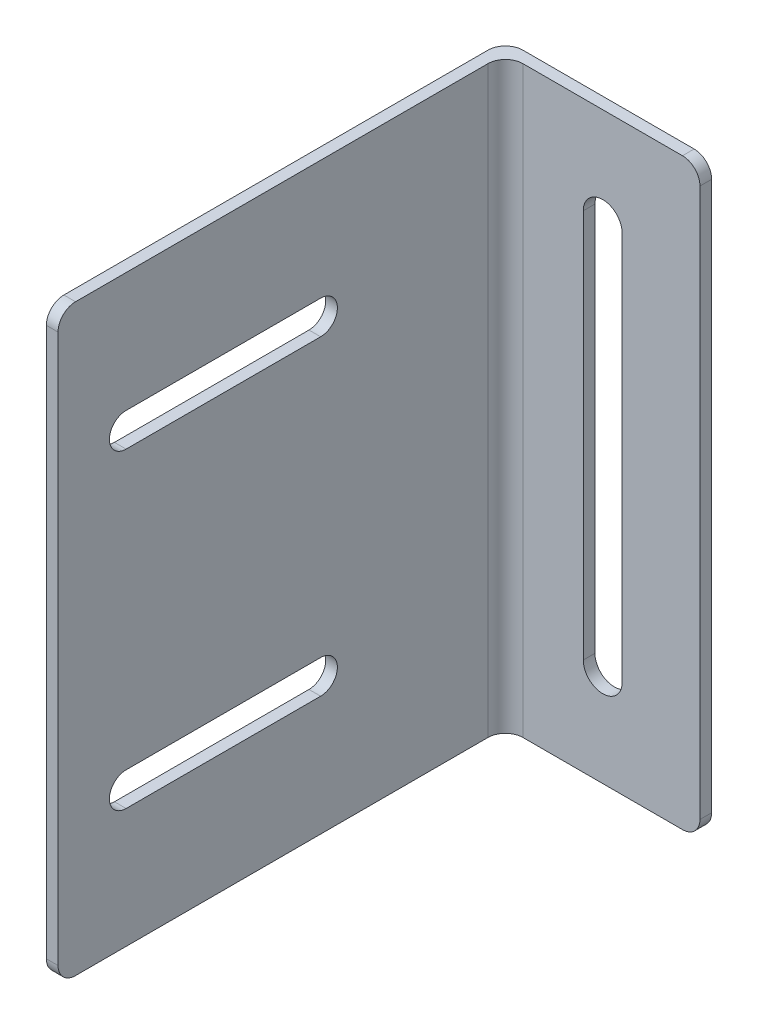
ISO-10303-21;
HEADER;
FILE_DESCRIPTION(('STEP AP214'),'2;1');
FILE_NAME('part.step','',(''),(''),'','','');
FILE_SCHEMA(('AUTOMOTIVE_DESIGN { 1 0 10303 214 1 1 1 1 }'));
ENDSEC;
DATA;
#1=APPLICATION_CONTEXT('core data for automotive mechanical design processes');
#2=APPLICATION_PROTOCOL_DEFINITION('international standard','automotive_design',2000,#1);
#3=PRODUCT_CONTEXT('',#1,'mechanical');
#4=PRODUCT('Part','Part','',(#3));
#5=PRODUCT_RELATED_PRODUCT_CATEGORY('part','',(#4));
#6=PRODUCT_DEFINITION_FORMATION('','',#4);
#7=PRODUCT_DEFINITION_CONTEXT('part definition',#1,'design');
#8=PRODUCT_DEFINITION('design','',#6,#7);
#9=PRODUCT_DEFINITION_SHAPE('','',#8);
#10=(LENGTH_UNIT() NAMED_UNIT(*) SI_UNIT(.MILLI.,.METRE.));
#11=(NAMED_UNIT(*) PLANE_ANGLE_UNIT() SI_UNIT($,.RADIAN.));
#12=(NAMED_UNIT(*) SI_UNIT($,.STERADIAN.) SOLID_ANGLE_UNIT());
#13=UNCERTAINTY_MEASURE_WITH_UNIT(LENGTH_MEASURE(1.E-05),#10,'distance_accuracy_value','');
#14=(GEOMETRIC_REPRESENTATION_CONTEXT(3) GLOBAL_UNCERTAINTY_ASSIGNED_CONTEXT((#13)) GLOBAL_UNIT_ASSIGNED_CONTEXT((#10,
#11,#12)) REPRESENTATION_CONTEXT('',''));
#15=CARTESIAN_POINT('',(0.,0.,0.));
#16=DIRECTION('',(0.,0.,1.));
#17=DIRECTION('',(1.,0.,0.));
#18=AXIS2_PLACEMENT_3D('',#15,#16,#17);
#19=CARTESIAN_POINT('',(25.,-25.,3.));
#20=DIRECTION('',(0.,0.,1.));
#21=DIRECTION('',(1.,0.,0.));
#22=AXIS2_PLACEMENT_3D('',#19,#20,#21);
#23=PLANE('',#22);
#24=DIRECTION('',(0.,1.,0.));
#25=VECTOR('',#24,1.);
#26=CARTESIAN_POINT('',(25.,125.,3.));
#27=LINE('',#26,#25);
#28=CARTESIAN_POINT('',(25.,-20.5,3.));
#29=VERTEX_POINT('',#28);
#30=CARTESIAN_POINT('',(25.,120.5,3.));
#31=VERTEX_POINT('',#30);
#32=EDGE_CURVE('E308',#29,#31,#27,.T.);
#33=ORIENTED_EDGE('',*,*,#32,.T.);
#34=CARTESIAN_POINT('',(20.5,120.5,3.));
#35=DIRECTION('',(0.,0.,1.));
#36=DIRECTION('',(1.,0.,0.));
#37=AXIS2_PLACEMENT_3D('',#34,#35,#36);
#38=CIRCLE('',#37,4.5);
#39=CARTESIAN_POINT('',(20.5,125.,3.));
#40=VERTEX_POINT('',#39);
#41=EDGE_CURVE('E333',#31,#40,#38,.T.);
#42=ORIENTED_EDGE('',*,*,#41,.T.);
#43=DIRECTION('',(-1.,0.,0.));
#44=VECTOR('',#43,1.);
#45=CARTESIAN_POINT('',(-25.,125.,3.));
#46=LINE('',#45,#44);
#47=CARTESIAN_POINT('',(-20.5,125.,3.));
#48=VERTEX_POINT('',#47);
#49=EDGE_CURVE('E296',#40,#48,#46,.T.);
#50=ORIENTED_EDGE('',*,*,#49,.T.);
#51=DIRECTION('',(0.,-1.,0.));
#52=VECTOR('',#51,1.);
#53=CARTESIAN_POINT('',(-20.5,-25.,3.));
#54=LINE('',#53,#52);
#55=CARTESIAN_POINT('',(-20.5,-25.,3.));
#56=VERTEX_POINT('',#55);
#57=EDGE_CURVE('E329',#48,#56,#54,.T.);
#58=ORIENTED_EDGE('',*,*,#57,.T.);
#59=DIRECTION('',(1.,0.,0.));
#60=VECTOR('',#59,1.);
#61=CARTESIAN_POINT('',(-25.,-25.,3.));
#62=LINE('',#61,#60);
#63=CARTESIAN_POINT('',(20.5,-25.,3.));
#64=VERTEX_POINT('',#63);
#65=EDGE_CURVE('E292',#56,#64,#62,.T.);
#66=ORIENTED_EDGE('',*,*,#65,.T.);
#67=CARTESIAN_POINT('',(20.5,-20.5,3.));
#68=DIRECTION('',(0.,0.,1.));
#69=DIRECTION('',(1.,0.,0.));
#70=AXIS2_PLACEMENT_3D('',#67,#68,#69);
#71=CIRCLE('',#70,4.5);
#72=EDGE_CURVE('E56',#64,#29,#71,.T.);
#73=ORIENTED_EDGE('',*,*,#72,.T.);
#74=EDGE_LOOP('',(#33,#42,#50,#58,#66,#73));
#75=FACE_BOUND('',#74,.T.);
#76=DIRECTION('',(0.,1.,0.));
#77=VECTOR('',#76,1.);
#78=CARTESIAN_POINT('',(5.,0.,3.));
#79=LINE('',#78,#77);
#80=CARTESIAN_POINT('',(5.,0.,3.));
#81=VERTEX_POINT('',#80);
#82=CARTESIAN_POINT('',(5.,100.,3.));
#83=VERTEX_POINT('',#82);
#84=EDGE_CURVE('E400',#81,#83,#79,.T.);
#85=ORIENTED_EDGE('',*,*,#84,.F.);
#86=CARTESIAN_POINT('',(0.,0.,3.));
#87=DIRECTION('',(0.,0.,1.));
#88=DIRECTION('',(1.,0.,0.));
#89=AXIS2_PLACEMENT_3D('',#86,#87,#88);
#90=CIRCLE('',#89,5.);
#91=CARTESIAN_POINT('',(-5.,0.,3.));
#92=VERTEX_POINT('',#91);
#93=EDGE_CURVE('E385',#92,#81,#90,.T.);
#94=ORIENTED_EDGE('',*,*,#93,.F.);
#95=DIRECTION('',(0.,-1.,0.));
#96=VECTOR('',#95,1.);
#97=CARTESIAN_POINT('',(-5.,0.,3.));
#98=LINE('',#97,#96);
#99=CARTESIAN_POINT('',(-5.,100.,3.));
#100=VERTEX_POINT('',#99);
#101=EDGE_CURVE('E381',#100,#92,#98,.T.);
#102=ORIENTED_EDGE('',*,*,#101,.F.);
#103=CARTESIAN_POINT('',(0.,100.,3.));
#104=DIRECTION('',(0.,0.,1.));
#105=DIRECTION('',(1.,0.,0.));
#106=AXIS2_PLACEMENT_3D('',#103,#104,#105);
#107=CIRCLE('',#106,5.);
#108=EDGE_CURVE('E397',#83,#100,#107,.T.);
#109=ORIENTED_EDGE('',*,*,#108,.F.);
#110=EDGE_LOOP('',(#85,#94,#102,#109));
#111=FACE_BOUND('',#110,.T.);
#112=ADVANCED_FACE('F34',(#75,#111),#23,.T.);
#113=CARTESIAN_POINT('',(25.,-25.,0.));
#114=DIRECTION('',(0.,0.,1.));
#115=DIRECTION('',(1.,0.,0.));
#116=AXIS2_PLACEMENT_3D('',#113,#114,#115);
#117=PLANE('',#116);
#118=DIRECTION('',(-1.,0.,0.));
#119=VECTOR('',#118,1.);
#120=CARTESIAN_POINT('',(-25.,125.,0.));
#121=LINE('',#120,#119);
#122=CARTESIAN_POINT('',(20.5,125.,0.));
#123=VERTEX_POINT('',#122);
#124=CARTESIAN_POINT('',(-23.5,125.,0.));
#125=VERTEX_POINT('',#124);
#126=EDGE_CURVE('E358',#123,#125,#121,.T.);
#127=ORIENTED_EDGE('',*,*,#126,.F.);
#128=CARTESIAN_POINT('',(20.5,120.5,0.));
#129=DIRECTION('',(0.,0.,1.));
#130=DIRECTION('',(1.,0.,0.));
#131=AXIS2_PLACEMENT_3D('',#128,#129,#130);
#132=CIRCLE('',#131,4.5);
#133=CARTESIAN_POINT('',(25.,120.5,0.));
#134=VERTEX_POINT('',#133);
#135=EDGE_CURVE('E323',#123,#134,#132,.F.);
#136=ORIENTED_EDGE('',*,*,#135,.T.);
#137=DIRECTION('',(0.,1.,0.));
#138=VECTOR('',#137,1.);
#139=CARTESIAN_POINT('',(25.,125.,0.));
#140=LINE('',#139,#138);
#141=CARTESIAN_POINT('',(25.,-20.5,0.));
#142=VERTEX_POINT('',#141);
#143=EDGE_CURVE('E366',#142,#134,#140,.T.);
#144=ORIENTED_EDGE('',*,*,#143,.F.);
#145=CARTESIAN_POINT('',(20.5,-20.5,0.));
#146=DIRECTION('',(0.,0.,1.));
#147=DIRECTION('',(1.,0.,0.));
#148=AXIS2_PLACEMENT_3D('',#145,#146,#147);
#149=CIRCLE('',#148,4.5);
#150=CARTESIAN_POINT('',(20.5,-25.,0.));
#151=VERTEX_POINT('',#150);
#152=EDGE_CURVE('E321',#142,#151,#149,.F.);
#153=ORIENTED_EDGE('',*,*,#152,.T.);
#154=DIRECTION('',(1.,0.,0.));
#155=VECTOR('',#154,1.);
#156=CARTESIAN_POINT('',(-25.,-25.,0.));
#157=LINE('',#156,#155);
#158=CARTESIAN_POINT('',(-23.5,-25.,0.));
#159=VERTEX_POINT('',#158);
#160=EDGE_CURVE('E301',#159,#151,#157,.T.);
#161=ORIENTED_EDGE('',*,*,#160,.F.);
#162=DIRECTION('',(0.,-1.,0.));
#163=VECTOR('',#162,1.);
#164=CARTESIAN_POINT('',(-23.5,125.,0.));
#165=LINE('',#164,#163);
#166=EDGE_CURVE('E319',#159,#125,#165,.F.);
#167=ORIENTED_EDGE('',*,*,#166,.T.);
#168=EDGE_LOOP('',(#127,#136,#144,#153,#161,#167));
#169=FACE_BOUND('',#168,.T.);
#170=CARTESIAN_POINT('',(0.,0.,0.));
#171=DIRECTION('',(0.,0.,1.));
#172=DIRECTION('',(1.,0.,0.));
#173=AXIS2_PLACEMENT_3D('',#170,#171,#172);
#174=CIRCLE('',#173,5.);
#175=CARTESIAN_POINT('',(-5.,0.,0.));
#176=VERTEX_POINT('',#175);
#177=CARTESIAN_POINT('',(5.,0.,0.));
#178=VERTEX_POINT('',#177);
#179=EDGE_CURVE('E392',#176,#178,#174,.T.);
#180=ORIENTED_EDGE('',*,*,#179,.T.);
#181=DIRECTION('',(0.,1.,0.));
#182=VECTOR('',#181,1.);
#183=CARTESIAN_POINT('',(5.,0.,0.));
#184=LINE('',#183,#182);
#185=CARTESIAN_POINT('',(5.,100.,0.));
#186=VERTEX_POINT('',#185);
#187=EDGE_CURVE('E389',#178,#186,#184,.T.);
#188=ORIENTED_EDGE('',*,*,#187,.T.);
#189=CARTESIAN_POINT('',(0.,100.,0.));
#190=DIRECTION('',(0.,0.,1.));
#191=DIRECTION('',(1.,0.,0.));
#192=AXIS2_PLACEMENT_3D('',#189,#190,#191);
#193=CIRCLE('',#192,5.);
#194=CARTESIAN_POINT('',(-5.,100.,0.));
#195=VERTEX_POINT('',#194);
#196=EDGE_CURVE('E386',#186,#195,#193,.T.);
#197=ORIENTED_EDGE('',*,*,#196,.T.);
#198=DIRECTION('',(0.,-1.,0.));
#199=VECTOR('',#198,1.);
#200=CARTESIAN_POINT('',(-5.,0.,0.));
#201=LINE('',#200,#199);
#202=EDGE_CURVE('E382',#195,#176,#201,.T.);
#203=ORIENTED_EDGE('',*,*,#202,.T.);
#204=EDGE_LOOP('',(#180,#188,#197,#203));
#205=FACE_BOUND('',#204,.T.);
#206=ADVANCED_FACE('F361',(#169,#205),#117,.F.);
#207=CARTESIAN_POINT('',(25.,125.,3.));
#208=DIRECTION('',(-1.,0.,0.));
#209=DIRECTION('',(0.,0.,1.));
#210=AXIS2_PLACEMENT_3D('',#207,#208,#209);
#211=PLANE('',#210);
#212=ORIENTED_EDGE('',*,*,#143,.T.);
#213=DIRECTION('',(0.,0.,-1.));
#214=VECTOR('',#213,1.);
#215=CARTESIAN_POINT('',(25.,120.5,3.));
#216=LINE('',#215,#214);
#217=EDGE_CURVE('E49',#134,#31,#216,.F.);
#218=ORIENTED_EDGE('',*,*,#217,.T.);
#219=ORIENTED_EDGE('',*,*,#32,.F.);
#220=DIRECTION('',(0.,0.,-1.));
#221=VECTOR('',#220,1.);
#222=CARTESIAN_POINT('',(25.,-20.5,3.));
#223=LINE('',#222,#221);
#224=EDGE_CURVE('E325',#29,#142,#223,.T.);
#225=ORIENTED_EDGE('',*,*,#224,.T.);
#226=EDGE_LOOP('',(#212,#218,#219,#225));
#227=FACE_BOUND('',#226,.T.);
#228=ADVANCED_FACE('F444',(#227),#211,.F.);
#229=CARTESIAN_POINT('',(-25.,125.,3.));
#230=DIRECTION('',(0.,-1.,0.));
#231=DIRECTION('',(0.,0.,-1.));
#232=AXIS2_PLACEMENT_3D('',#229,#230,#231);
#233=PLANE('',#232);
#234=DIRECTION('',(0.,0.,1.));
#235=VECTOR('',#234,1.);
#236=CARTESIAN_POINT('',(-28.,125.,59.));
#237=LINE('',#236,#235);
#238=CARTESIAN_POINT('',(-28.,125.,4.5));
#239=VERTEX_POINT('',#238);
#240=CARTESIAN_POINT('',(-28.,125.,113.5));
#241=VERTEX_POINT('',#240);
#242=EDGE_CURVE('E241',#239,#241,#237,.T.);
#243=ORIENTED_EDGE('',*,*,#242,.T.);
#244=DIRECTION('',(1.,0.,0.));
#245=VECTOR('',#244,1.);
#246=CARTESIAN_POINT('',(-25.,125.,113.5));
#247=LINE('',#246,#245);
#248=CARTESIAN_POINT('',(-25.,125.,113.5));
#249=VERTEX_POINT('',#248);
#250=EDGE_CURVE('E316',#241,#249,#247,.T.);
#251=ORIENTED_EDGE('',*,*,#250,.T.);
#252=DIRECTION('',(0.,0.,1.));
#253=VECTOR('',#252,1.);
#254=CARTESIAN_POINT('',(-25.,125.,59.));
#255=LINE('',#254,#253);
#256=CARTESIAN_POINT('',(-25.,125.,7.5));
#257=VERTEX_POINT('',#256);
#258=EDGE_CURVE('E272',#257,#249,#255,.T.);
#259=ORIENTED_EDGE('',*,*,#258,.F.);
#260=CARTESIAN_POINT('',(-20.5,125.,7.5));
#261=DIRECTION('',(0.,-1.,0.));
#262=DIRECTION('',(0.,0.,-1.));
#263=AXIS2_PLACEMENT_3D('',#260,#261,#262);
#264=CIRCLE('',#263,4.5);
#265=EDGE_CURVE('E11',#257,#48,#264,.T.);
#266=ORIENTED_EDGE('',*,*,#265,.T.);
#267=ORIENTED_EDGE('',*,*,#49,.F.);
#268=DIRECTION('',(0.,0.,-1.));
#269=VECTOR('',#268,1.);
#270=CARTESIAN_POINT('',(20.5,125.,3.));
#271=LINE('',#270,#269);
#272=EDGE_CURVE('E313',#40,#123,#271,.T.);
#273=ORIENTED_EDGE('',*,*,#272,.T.);
#274=ORIENTED_EDGE('',*,*,#126,.T.);
#275=CARTESIAN_POINT('',(-23.5,125.,4.5));
#276=DIRECTION('',(0.,-1.,0.));
#277=DIRECTION('',(0.,0.,-1.));
#278=AXIS2_PLACEMENT_3D('',#275,#276,#277);
#279=CIRCLE('',#278,4.5);
#280=EDGE_CURVE('E311',#125,#239,#279,.F.);
#281=ORIENTED_EDGE('',*,*,#280,.T.);
#282=EDGE_LOOP('',(#243,#251,#259,#266,#267,#273,#274,#281));
#283=FACE_BOUND('',#282,.T.);
#284=ADVANCED_FACE('F350',(#283),#233,.F.);
#285=CARTESIAN_POINT('',(-25.,-25.,3.));
#286=DIRECTION('',(0.,1.,0.));
#287=DIRECTION('',(0.,0.,1.));
#288=AXIS2_PLACEMENT_3D('',#285,#286,#287);
#289=PLANE('',#288);
#290=DIRECTION('',(0.,0.,1.));
#291=VECTOR('',#290,1.);
#292=CARTESIAN_POINT('',(-25.,-25.,59.));
#293=LINE('',#292,#291);
#294=CARTESIAN_POINT('',(-25.,-25.,7.5));
#295=VERTEX_POINT('',#294);
#296=CARTESIAN_POINT('',(-25.,-25.,113.5));
#297=VERTEX_POINT('',#296);
#298=EDGE_CURVE('E219',#295,#297,#293,.T.);
#299=ORIENTED_EDGE('',*,*,#298,.T.);
#300=DIRECTION('',(1.,0.,0.));
#301=VECTOR('',#300,1.);
#302=CARTESIAN_POINT('',(-28.,-25.,113.5));
#303=LINE('',#302,#301);
#304=CARTESIAN_POINT('',(-28.,-25.,113.5));
#305=VERTEX_POINT('',#304);
#306=EDGE_CURVE('E486',#297,#305,#303,.F.);
#307=ORIENTED_EDGE('',*,*,#306,.T.);
#308=DIRECTION('',(0.,0.,1.));
#309=VECTOR('',#308,1.);
#310=CARTESIAN_POINT('',(-28.,-25.,59.));
#311=LINE('',#310,#309);
#312=CARTESIAN_POINT('',(-28.,-25.,4.5));
#313=VERTEX_POINT('',#312);
#314=EDGE_CURVE('E244',#313,#305,#311,.T.);
#315=ORIENTED_EDGE('',*,*,#314,.F.);
#316=CARTESIAN_POINT('',(-23.5,-25.,4.5));
#317=DIRECTION('',(0.,1.,0.));
#318=DIRECTION('',(0.,0.,1.));
#319=AXIS2_PLACEMENT_3D('',#316,#317,#318);
#320=CIRCLE('',#319,4.5);
#321=EDGE_CURVE('E291',#313,#159,#320,.F.);
#322=ORIENTED_EDGE('',*,*,#321,.T.);
#323=ORIENTED_EDGE('',*,*,#160,.T.);
#324=DIRECTION('',(0.,0.,-1.));
#325=VECTOR('',#324,1.);
#326=CARTESIAN_POINT('',(20.5,-25.,3.));
#327=LINE('',#326,#325);
#328=EDGE_CURVE('E489',#151,#64,#327,.F.);
#329=ORIENTED_EDGE('',*,*,#328,.T.);
#330=ORIENTED_EDGE('',*,*,#65,.F.);
#331=CARTESIAN_POINT('',(-20.5,-25.,7.5));
#332=DIRECTION('',(0.,1.,0.));
#333=DIRECTION('',(0.,0.,1.));
#334=AXIS2_PLACEMENT_3D('',#331,#332,#333);
#335=CIRCLE('',#334,4.5);
#336=EDGE_CURVE('E42',#56,#295,#335,.T.);
#337=ORIENTED_EDGE('',*,*,#336,.T.);
#338=EDGE_LOOP('',(#299,#307,#315,#322,#323,#329,#330,#337));
#339=FACE_BOUND('',#338,.T.);
#340=ADVANCED_FACE('F337',(#339),#289,.F.);
#341=CARTESIAN_POINT('',(0.,0.,3.));
#342=DIRECTION('',(0.,0.,-1.));
#343=DIRECTION('',(-1.,0.,0.));
#344=AXIS2_PLACEMENT_3D('',#341,#342,#343);
#345=CYLINDRICAL_SURFACE('',#344,5.);
#346=ORIENTED_EDGE('',*,*,#179,.F.);
#347=DIRECTION('',(0.,0.,-1.));
#348=VECTOR('',#347,1.);
#349=CARTESIAN_POINT('',(-5.,0.,3.));
#350=LINE('',#349,#348);
#351=EDGE_CURVE('E378',#92,#176,#350,.T.);
#352=ORIENTED_EDGE('',*,*,#351,.F.);
#353=ORIENTED_EDGE('',*,*,#93,.T.);
#354=DIRECTION('',(0.,0.,-1.));
#355=VECTOR('',#354,1.);
#356=CARTESIAN_POINT('',(5.,0.,3.));
#357=LINE('',#356,#355);
#358=EDGE_CURVE('E368',#81,#178,#357,.T.);
#359=ORIENTED_EDGE('',*,*,#358,.T.);
#360=EDGE_LOOP('',(#346,#352,#353,#359));
#361=FACE_BOUND('',#360,.T.);
#362=ADVANCED_FACE('F447',(#361),#345,.F.);
#363=CARTESIAN_POINT('',(5.,0.,3.));
#364=DIRECTION('',(-1.,0.,0.));
#365=DIRECTION('',(0.,0.,1.));
#366=AXIS2_PLACEMENT_3D('',#363,#364,#365);
#367=PLANE('',#366);
#368=ORIENTED_EDGE('',*,*,#187,.F.);
#369=ORIENTED_EDGE('',*,*,#358,.F.);
#370=ORIENTED_EDGE('',*,*,#84,.T.);
#371=DIRECTION('',(0.,0.,-1.));
#372=VECTOR('',#371,1.);
#373=CARTESIAN_POINT('',(5.,100.,3.));
#374=LINE('',#373,#372);
#375=EDGE_CURVE('E374',#83,#186,#374,.T.);
#376=ORIENTED_EDGE('',*,*,#375,.T.);
#377=EDGE_LOOP('',(#368,#369,#370,#376));
#378=FACE_BOUND('',#377,.T.);
#379=ADVANCED_FACE('F529',(#378),#367,.T.);
#380=CARTESIAN_POINT('',(0.,100.,3.));
#381=DIRECTION('',(0.,0.,-1.));
#382=DIRECTION('',(-1.,0.,0.));
#383=AXIS2_PLACEMENT_3D('',#380,#381,#382);
#384=CYLINDRICAL_SURFACE('',#383,5.);
#385=ORIENTED_EDGE('',*,*,#196,.F.);
#386=ORIENTED_EDGE('',*,*,#375,.F.);
#387=ORIENTED_EDGE('',*,*,#108,.T.);
#388=DIRECTION('',(0.,0.,-1.));
#389=VECTOR('',#388,1.);
#390=CARTESIAN_POINT('',(-5.,100.,3.));
#391=LINE('',#390,#389);
#392=EDGE_CURVE('E376',#100,#195,#391,.T.);
#393=ORIENTED_EDGE('',*,*,#392,.T.);
#394=EDGE_LOOP('',(#385,#386,#387,#393));
#395=FACE_BOUND('',#394,.T.);
#396=ADVANCED_FACE('F506',(#395),#384,.F.);
#397=CARTESIAN_POINT('',(-5.,0.,3.));
#398=DIRECTION('',(1.,0.,0.));
#399=DIRECTION('',(0.,0.,-1.));
#400=AXIS2_PLACEMENT_3D('',#397,#398,#399);
#401=PLANE('',#400);
#402=ORIENTED_EDGE('',*,*,#202,.F.);
#403=ORIENTED_EDGE('',*,*,#392,.F.);
#404=ORIENTED_EDGE('',*,*,#101,.T.);
#405=ORIENTED_EDGE('',*,*,#351,.T.);
#406=EDGE_LOOP('',(#402,#403,#404,#405));
#407=FACE_BOUND('',#406,.T.);
#408=ADVANCED_FACE('F499',(#407),#401,.T.);
#409=CARTESIAN_POINT('',(-28.,-98.5884489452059,118.));
#410=DIRECTION('',(0.,0.,1.));
#411=DIRECTION('',(1.,0.,0.));
#412=AXIS2_PLACEMENT_3D('',#409,#410,#411);
#413=PLANE('',#412);
#414=DIRECTION('',(0.,-1.,0.));
#415=VECTOR('',#414,1.);
#416=CARTESIAN_POINT('',(-28.,-98.5884489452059,118.));
#417=LINE('',#416,#415);
#418=CARTESIAN_POINT('',(-28.,120.5,118.));
#419=VERTEX_POINT('',#418);
#420=CARTESIAN_POINT('',(-28.,-20.5,118.));
#421=VERTEX_POINT('',#420);
#422=EDGE_CURVE('E238',#419,#421,#417,.T.);
#423=ORIENTED_EDGE('',*,*,#422,.T.);
#424=DIRECTION('',(1.,0.,0.));
#425=VECTOR('',#424,1.);
#426=CARTESIAN_POINT('',(-25.,-20.5,118.));
#427=LINE('',#426,#425);
#428=CARTESIAN_POINT('',(-25.,-20.5,118.));
#429=VERTEX_POINT('',#428);
#430=EDGE_CURVE('E281',#421,#429,#427,.T.);
#431=ORIENTED_EDGE('',*,*,#430,.T.);
#432=DIRECTION('',(0.,-1.,0.));
#433=VECTOR('',#432,1.);
#434=CARTESIAN_POINT('',(-25.,-98.5884489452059,118.));
#435=LINE('',#434,#433);
#436=CARTESIAN_POINT('',(-25.,120.5,118.));
#437=VERTEX_POINT('',#436);
#438=EDGE_CURVE('E269',#437,#429,#435,.T.);
#439=ORIENTED_EDGE('',*,*,#438,.F.);
#440=DIRECTION('',(1.,0.,0.));
#441=VECTOR('',#440,1.);
#442=CARTESIAN_POINT('',(-28.,120.5,118.));
#443=LINE('',#442,#441);
#444=EDGE_CURVE('E295',#437,#419,#443,.F.);
#445=ORIENTED_EDGE('',*,*,#444,.T.);
#446=EDGE_LOOP('',(#423,#431,#439,#445));
#447=FACE_BOUND('',#446,.T.);
#448=ADVANCED_FACE('F497',(#447),#413,.T.);
#449=CARTESIAN_POINT('',(-28.,90.0000000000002,100.5));
#450=DIRECTION('',(1.,0.,0.));
#451=DIRECTION('',(0.,0.,-1.));
#452=AXIS2_PLACEMENT_3D('',#449,#450,#451);
#453=CYLINDRICAL_SURFACE('',#452,4.30000000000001);
#454=CARTESIAN_POINT('',(-25.,90.0000000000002,100.5));
#455=DIRECTION('',(-1.,0.,0.));
#456=DIRECTION('',(0.,0.,1.));
#457=AXIS2_PLACEMENT_3D('',#454,#455,#456);
#458=CIRCLE('',#457,4.30000000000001);
#459=CARTESIAN_POINT('',(-25.,85.7,100.5));
#460=VERTEX_POINT('',#459);
#461=CARTESIAN_POINT('',(-25.,94.3,100.5));
#462=VERTEX_POINT('',#461);
#463=EDGE_CURVE('E257',#460,#462,#458,.T.);
#464=ORIENTED_EDGE('',*,*,#463,.F.);
#465=DIRECTION('',(1.,0.,0.));
#466=VECTOR('',#465,1.);
#467=CARTESIAN_POINT('',(-28.,85.7,100.5));
#468=LINE('',#467,#466);
#469=CARTESIAN_POINT('',(-28.,85.7,100.5));
#470=VERTEX_POINT('',#469);
#471=EDGE_CURVE('E395',#470,#460,#468,.T.);
#472=ORIENTED_EDGE('',*,*,#471,.F.);
#473=CARTESIAN_POINT('',(-28.,90.0000000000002,100.5));
#474=DIRECTION('',(-1.,0.,0.));
#475=DIRECTION('',(0.,0.,1.));
#476=AXIS2_PLACEMENT_3D('',#473,#474,#475);
#477=CIRCLE('',#476,4.30000000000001);
#478=CARTESIAN_POINT('',(-28.,94.3,100.5));
#479=VERTEX_POINT('',#478);
#480=EDGE_CURVE('E227',#470,#479,#477,.T.);
#481=ORIENTED_EDGE('',*,*,#480,.T.);
#482=DIRECTION('',(1.,0.,0.));
#483=VECTOR('',#482,1.);
#484=CARTESIAN_POINT('',(-28.,94.3,100.5));
#485=LINE('',#484,#483);
#486=EDGE_CURVE('E206',#479,#462,#485,.T.);
#487=ORIENTED_EDGE('',*,*,#486,.T.);
#488=EDGE_LOOP('',(#464,#472,#481,#487));
#489=FACE_BOUND('',#488,.T.);
#490=ADVANCED_FACE('F414',(#489),#453,.F.);
#491=CARTESIAN_POINT('',(-28.,85.7,59.));
#492=DIRECTION('',(0.,1.,0.));
#493=DIRECTION('',(0.,0.,1.));
#494=AXIS2_PLACEMENT_3D('',#491,#492,#493);
#495=PLANE('',#494);
#496=DIRECTION('',(0.,0.,1.));
#497=VECTOR('',#496,1.);
#498=CARTESIAN_POINT('',(-25.,85.7,59.));
#499=LINE('',#498,#497);
#500=CARTESIAN_POINT('',(-25.,85.7,50.5));
#501=VERTEX_POINT('',#500);
#502=EDGE_CURVE('E260',#501,#460,#499,.T.);
#503=ORIENTED_EDGE('',*,*,#502,.F.);
#504=DIRECTION('',(1.,0.,0.));
#505=VECTOR('',#504,1.);
#506=CARTESIAN_POINT('',(-28.,85.7,50.5));
#507=LINE('',#506,#505);
#508=CARTESIAN_POINT('',(-28.,85.7,50.5));
#509=VERTEX_POINT('',#508);
#510=EDGE_CURVE('E408',#509,#501,#507,.T.);
#511=ORIENTED_EDGE('',*,*,#510,.F.);
#512=DIRECTION('',(0.,0.,1.));
#513=VECTOR('',#512,1.);
#514=CARTESIAN_POINT('',(-28.,85.7,59.));
#515=LINE('',#514,#513);
#516=EDGE_CURVE('E230',#509,#470,#515,.T.);
#517=ORIENTED_EDGE('',*,*,#516,.T.);
#518=ORIENTED_EDGE('',*,*,#471,.T.);
#519=EDGE_LOOP('',(#503,#511,#517,#518));
#520=FACE_BOUND('',#519,.T.);
#521=ADVANCED_FACE('F424',(#520),#495,.T.);
#522=CARTESIAN_POINT('',(-28.,89.9999999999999,50.5));
#523=DIRECTION('',(1.,0.,0.));
#524=DIRECTION('',(0.,0.,-1.));
#525=AXIS2_PLACEMENT_3D('',#522,#523,#524);
#526=CYLINDRICAL_SURFACE('',#525,4.30000000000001);
#527=CARTESIAN_POINT('',(-25.,89.9999999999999,50.5));
#528=DIRECTION('',(-1.,0.,0.));
#529=DIRECTION('',(0.,0.,1.));
#530=AXIS2_PLACEMENT_3D('',#527,#528,#529);
#531=CIRCLE('',#530,4.30000000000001);
#532=CARTESIAN_POINT('',(-25.,94.3,50.5));
#533=VERTEX_POINT('',#532);
#534=EDGE_CURVE('E263',#533,#501,#531,.T.);
#535=ORIENTED_EDGE('',*,*,#534,.F.);
#536=DIRECTION('',(1.,0.,0.));
#537=VECTOR('',#536,1.);
#538=CARTESIAN_POINT('',(-28.,94.3,50.5));
#539=LINE('',#538,#537);
#540=CARTESIAN_POINT('',(-28.,94.3,50.5));
#541=VERTEX_POINT('',#540);
#542=EDGE_CURVE('E410',#541,#533,#539,.T.);
#543=ORIENTED_EDGE('',*,*,#542,.F.);
#544=CARTESIAN_POINT('',(-28.,89.9999999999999,50.5));
#545=DIRECTION('',(-1.,0.,0.));
#546=DIRECTION('',(0.,0.,1.));
#547=AXIS2_PLACEMENT_3D('',#544,#545,#546);
#548=CIRCLE('',#547,4.30000000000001);
#549=EDGE_CURVE('E233',#541,#509,#548,.T.);
#550=ORIENTED_EDGE('',*,*,#549,.T.);
#551=ORIENTED_EDGE('',*,*,#510,.T.);
#552=EDGE_LOOP('',(#535,#543,#550,#551));
#553=FACE_BOUND('',#552,.T.);
#554=ADVANCED_FACE('F429',(#553),#526,.F.);
#555=CARTESIAN_POINT('',(-28.,9.9999999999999,100.5));
#556=DIRECTION('',(1.,0.,0.));
#557=DIRECTION('',(0.,0.,-1.));
#558=AXIS2_PLACEMENT_3D('',#555,#556,#557);
#559=CYLINDRICAL_SURFACE('',#558,4.30000000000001);
#560=CARTESIAN_POINT('',(-25.,9.9999999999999,100.5));
#561=DIRECTION('',(-1.,0.,0.));
#562=DIRECTION('',(0.,0.,1.));
#563=AXIS2_PLACEMENT_3D('',#560,#561,#562);
#564=CIRCLE('',#563,4.30000000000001);
#565=CARTESIAN_POINT('',(-25.,5.69999999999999,100.5));
#566=VERTEX_POINT('',#565);
#567=CARTESIAN_POINT('',(-25.,14.3,100.5));
#568=VERTEX_POINT('',#567);
#569=EDGE_CURVE('E201',#566,#568,#564,.T.);
#570=ORIENTED_EDGE('',*,*,#569,.F.);
#571=DIRECTION('',(1.,0.,0.));
#572=VECTOR('',#571,1.);
#573=CARTESIAN_POINT('',(-28.,5.69999999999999,100.5));
#574=LINE('',#573,#572);
#575=CARTESIAN_POINT('',(-28.,5.69999999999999,100.5));
#576=VERTEX_POINT('',#575);
#577=EDGE_CURVE('E196',#576,#566,#574,.T.);
#578=ORIENTED_EDGE('',*,*,#577,.F.);
#579=CARTESIAN_POINT('',(-28.,9.9999999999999,100.5));
#580=DIRECTION('',(-1.,0.,0.));
#581=DIRECTION('',(0.,0.,1.));
#582=AXIS2_PLACEMENT_3D('',#579,#580,#581);
#583=CIRCLE('',#582,4.30000000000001);
#584=CARTESIAN_POINT('',(-28.,14.3,100.5));
#585=VERTEX_POINT('',#584);
#586=EDGE_CURVE('E199',#576,#585,#583,.T.);
#587=ORIENTED_EDGE('',*,*,#586,.T.);
#588=DIRECTION('',(1.,0.,0.));
#589=VECTOR('',#588,1.);
#590=CARTESIAN_POINT('',(-28.,14.3,100.5));
#591=LINE('',#590,#589);
#592=EDGE_CURVE('E247',#585,#568,#591,.T.);
#593=ORIENTED_EDGE('',*,*,#592,.T.);
#594=EDGE_LOOP('',(#570,#578,#587,#593));
#595=FACE_BOUND('',#594,.T.);
#596=ADVANCED_FACE('F198',(#595),#559,.F.);
#597=CARTESIAN_POINT('',(-28.,5.69999999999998,59.));
#598=DIRECTION('',(0.,1.,0.));
#599=DIRECTION('',(0.,0.,1.));
#600=AXIS2_PLACEMENT_3D('',#597,#598,#599);
#601=PLANE('',#600);
#602=DIRECTION('',(0.,0.,1.));
#603=VECTOR('',#602,1.);
#604=CARTESIAN_POINT('',(-25.,5.69999999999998,59.));
#605=LINE('',#604,#603);
#606=CARTESIAN_POINT('',(-25.,5.69999999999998,50.5));
#607=VERTEX_POINT('',#606);
#608=EDGE_CURVE('E249',#607,#566,#605,.T.);
#609=ORIENTED_EDGE('',*,*,#608,.F.);
#610=DIRECTION('',(1.,0.,0.));
#611=VECTOR('',#610,1.);
#612=CARTESIAN_POINT('',(-28.,5.69999999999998,50.5));
#613=LINE('',#612,#611);
#614=CARTESIAN_POINT('',(-28.,5.69999999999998,50.5));
#615=VERTEX_POINT('',#614);
#616=EDGE_CURVE('E207',#615,#607,#613,.T.);
#617=ORIENTED_EDGE('',*,*,#616,.F.);
#618=DIRECTION('',(0.,0.,1.));
#619=VECTOR('',#618,1.);
#620=CARTESIAN_POINT('',(-28.,5.69999999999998,59.));
#621=LINE('',#620,#619);
#622=EDGE_CURVE('E214',#615,#576,#621,.T.);
#623=ORIENTED_EDGE('',*,*,#622,.T.);
#624=ORIENTED_EDGE('',*,*,#577,.T.);
#625=EDGE_LOOP('',(#609,#617,#623,#624));
#626=FACE_BOUND('',#625,.T.);
#627=ADVANCED_FACE('F221',(#626),#601,.T.);
#628=CARTESIAN_POINT('',(-28.,9.99999999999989,50.5));
#629=DIRECTION('',(1.,0.,0.));
#630=DIRECTION('',(0.,0.,-1.));
#631=AXIS2_PLACEMENT_3D('',#628,#629,#630);
#632=CYLINDRICAL_SURFACE('',#631,4.30000000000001);
#633=CARTESIAN_POINT('',(-25.,9.99999999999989,50.5));
#634=DIRECTION('',(-1.,0.,0.));
#635=DIRECTION('',(0.,0.,1.));
#636=AXIS2_PLACEMENT_3D('',#633,#634,#635);
#637=CIRCLE('',#636,4.30000000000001);
#638=CARTESIAN_POINT('',(-25.,14.3,50.5));
#639=VERTEX_POINT('',#638);
#640=EDGE_CURVE('E251',#639,#607,#637,.T.);
#641=ORIENTED_EDGE('',*,*,#640,.F.);
#642=DIRECTION('',(1.,0.,0.));
#643=VECTOR('',#642,1.);
#644=CARTESIAN_POINT('',(-28.,14.3,50.5));
#645=LINE('',#644,#643);
#646=CARTESIAN_POINT('',(-28.,14.3,50.5));
#647=VERTEX_POINT('',#646);
#648=EDGE_CURVE('E404',#647,#639,#645,.T.);
#649=ORIENTED_EDGE('',*,*,#648,.F.);
#650=CARTESIAN_POINT('',(-28.,9.99999999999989,50.5));
#651=DIRECTION('',(-1.,0.,0.));
#652=DIRECTION('',(0.,0.,1.));
#653=AXIS2_PLACEMENT_3D('',#650,#651,#652);
#654=CIRCLE('',#653,4.30000000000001);
#655=EDGE_CURVE('E222',#647,#615,#654,.T.);
#656=ORIENTED_EDGE('',*,*,#655,.T.);
#657=ORIENTED_EDGE('',*,*,#616,.T.);
#658=EDGE_LOOP('',(#641,#649,#656,#657));
#659=FACE_BOUND('',#658,.T.);
#660=ADVANCED_FACE('F513',(#659),#632,.F.);
#661=CARTESIAN_POINT('',(-28.,94.3,59.));
#662=DIRECTION('',(0.,1.,0.));
#663=DIRECTION('',(0.,0.,1.));
#664=AXIS2_PLACEMENT_3D('',#661,#662,#663);
#665=PLANE('',#664);
#666=DIRECTION('',(0.,0.,1.));
#667=VECTOR('',#666,1.);
#668=CARTESIAN_POINT('',(-25.,94.3,59.));
#669=LINE('',#668,#667);
#670=EDGE_CURVE('E266',#533,#462,#669,.T.);
#671=ORIENTED_EDGE('',*,*,#670,.T.);
#672=ORIENTED_EDGE('',*,*,#486,.F.);
#673=DIRECTION('',(0.,0.,1.));
#674=VECTOR('',#673,1.);
#675=CARTESIAN_POINT('',(-28.,94.3,59.));
#676=LINE('',#675,#674);
#677=EDGE_CURVE('E236',#541,#479,#676,.T.);
#678=ORIENTED_EDGE('',*,*,#677,.F.);
#679=ORIENTED_EDGE('',*,*,#542,.T.);
#680=EDGE_LOOP('',(#671,#672,#678,#679));
#681=FACE_BOUND('',#680,.T.);
#682=ADVANCED_FACE('F419',(#681),#665,.F.);
#683=CARTESIAN_POINT('',(-28.,14.3,59.));
#684=DIRECTION('',(0.,1.,0.));
#685=DIRECTION('',(0.,0.,1.));
#686=AXIS2_PLACEMENT_3D('',#683,#684,#685);
#687=PLANE('',#686);
#688=DIRECTION('',(0.,0.,1.));
#689=VECTOR('',#688,1.);
#690=CARTESIAN_POINT('',(-25.,14.3,59.));
#691=LINE('',#690,#689);
#692=EDGE_CURVE('E254',#639,#568,#691,.T.);
#693=ORIENTED_EDGE('',*,*,#692,.T.);
#694=ORIENTED_EDGE('',*,*,#592,.F.);
#695=DIRECTION('',(0.,0.,1.));
#696=VECTOR('',#695,1.);
#697=CARTESIAN_POINT('',(-28.,14.3,59.));
#698=LINE('',#697,#696);
#699=EDGE_CURVE('E217',#647,#585,#698,.T.);
#700=ORIENTED_EDGE('',*,*,#699,.F.);
#701=ORIENTED_EDGE('',*,*,#648,.T.);
#702=EDGE_LOOP('',(#693,#694,#700,#701));
#703=FACE_BOUND('',#702,.T.);
#704=ADVANCED_FACE('F512',(#703),#687,.F.);
#705=CARTESIAN_POINT('',(-28.,-98.5884489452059,59.));
#706=DIRECTION('',(-1.,0.,0.));
#707=DIRECTION('',(0.,0.,1.));
#708=AXIS2_PLACEMENT_3D('',#705,#706,#707);
#709=PLANE('',#708);
#710=ORIENTED_EDGE('',*,*,#586,.F.);
#711=ORIENTED_EDGE('',*,*,#622,.F.);
#712=ORIENTED_EDGE('',*,*,#655,.F.);
#713=ORIENTED_EDGE('',*,*,#699,.T.);
#714=EDGE_LOOP('',(#710,#711,#712,#713));
#715=FACE_BOUND('',#714,.T.);
#716=ORIENTED_EDGE('',*,*,#480,.F.);
#717=ORIENTED_EDGE('',*,*,#516,.F.);
#718=ORIENTED_EDGE('',*,*,#549,.F.);
#719=ORIENTED_EDGE('',*,*,#677,.T.);
#720=EDGE_LOOP('',(#716,#717,#718,#719));
#721=FACE_BOUND('',#720,.T.);
#722=ORIENTED_EDGE('',*,*,#314,.T.);
#723=CARTESIAN_POINT('',(-28.,-20.5,113.5));
#724=DIRECTION('',(-1.,0.,0.));
#725=DIRECTION('',(0.,0.,1.));
#726=AXIS2_PLACEMENT_3D('',#723,#724,#725);
#727=CIRCLE('',#726,4.5);
#728=EDGE_CURVE('E309',#305,#421,#727,.T.);
#729=ORIENTED_EDGE('',*,*,#728,.T.);
#730=ORIENTED_EDGE('',*,*,#422,.F.);
#731=CARTESIAN_POINT('',(-28.,120.5,113.5));
#732=DIRECTION('',(-1.,0.,0.));
#733=DIRECTION('',(0.,0.,1.));
#734=AXIS2_PLACEMENT_3D('',#731,#732,#733);
#735=CIRCLE('',#734,4.5);
#736=EDGE_CURVE('E484',#419,#241,#735,.T.);
#737=ORIENTED_EDGE('',*,*,#736,.T.);
#738=ORIENTED_EDGE('',*,*,#242,.F.);
#739=DIRECTION('',(0.,-1.,0.));
#740=VECTOR('',#739,1.);
#741=CARTESIAN_POINT('',(-28.,-25.,4.5));
#742=LINE('',#741,#740);
#743=EDGE_CURVE('E478',#239,#313,#742,.T.);
#744=ORIENTED_EDGE('',*,*,#743,.T.);
#745=EDGE_LOOP('',(#722,#729,#730,#737,#738,#744));
#746=FACE_BOUND('',#745,.T.);
#747=ADVANCED_FACE('F211',(#715,#721,#746),#709,.T.);
#748=CARTESIAN_POINT('',(-25.,-98.5884489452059,59.));
#749=DIRECTION('',(-1.,0.,0.));
#750=DIRECTION('',(0.,0.,1.));
#751=AXIS2_PLACEMENT_3D('',#748,#749,#750);
#752=PLANE('',#751);
#753=ORIENTED_EDGE('',*,*,#438,.T.);
#754=CARTESIAN_POINT('',(-25.,-20.5,113.5));
#755=DIRECTION('',(-1.,0.,0.));
#756=DIRECTION('',(0.,0.,1.));
#757=AXIS2_PLACEMENT_3D('',#754,#755,#756);
#758=CIRCLE('',#757,4.5);
#759=EDGE_CURVE('E289',#429,#297,#758,.F.);
#760=ORIENTED_EDGE('',*,*,#759,.T.);
#761=ORIENTED_EDGE('',*,*,#298,.F.);
#762=DIRECTION('',(0.,-1.,0.));
#763=VECTOR('',#762,1.);
#764=CARTESIAN_POINT('',(-25.,-98.5884489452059,7.5));
#765=LINE('',#764,#763);
#766=EDGE_CURVE('E285',#295,#257,#765,.F.);
#767=ORIENTED_EDGE('',*,*,#766,.T.);
#768=ORIENTED_EDGE('',*,*,#258,.T.);
#769=CARTESIAN_POINT('',(-25.,120.5,113.5));
#770=DIRECTION('',(-1.,0.,0.));
#771=DIRECTION('',(0.,0.,1.));
#772=AXIS2_PLACEMENT_3D('',#769,#770,#771);
#773=CIRCLE('',#772,4.5);
#774=EDGE_CURVE('E287',#249,#437,#773,.F.);
#775=ORIENTED_EDGE('',*,*,#774,.T.);
#776=EDGE_LOOP('',(#753,#760,#761,#767,#768,#775));
#777=FACE_BOUND('',#776,.T.);
#778=ORIENTED_EDGE('',*,*,#569,.T.);
#779=ORIENTED_EDGE('',*,*,#692,.F.);
#780=ORIENTED_EDGE('',*,*,#640,.T.);
#781=ORIENTED_EDGE('',*,*,#608,.T.);
#782=EDGE_LOOP('',(#778,#779,#780,#781));
#783=FACE_BOUND('',#782,.T.);
#784=ORIENTED_EDGE('',*,*,#463,.T.);
#785=ORIENTED_EDGE('',*,*,#670,.F.);
#786=ORIENTED_EDGE('',*,*,#534,.T.);
#787=ORIENTED_EDGE('',*,*,#502,.T.);
#788=EDGE_LOOP('',(#784,#785,#786,#787));
#789=FACE_BOUND('',#788,.T.);
#790=ADVANCED_FACE('F343',(#777,#783,#789),#752,.F.);
#791=CARTESIAN_POINT('',(-28.,-20.5,113.5));
#792=DIRECTION('',(-1.,0.,0.));
#793=DIRECTION('',(0.,0.,1.));
#794=AXIS2_PLACEMENT_3D('',#791,#792,#793);
#795=CYLINDRICAL_SURFACE('',#794,4.5);
#796=ORIENTED_EDGE('',*,*,#728,.F.);
#797=ORIENTED_EDGE('',*,*,#306,.F.);
#798=ORIENTED_EDGE('',*,*,#759,.F.);
#799=ORIENTED_EDGE('',*,*,#430,.F.);
#800=EDGE_LOOP('',(#796,#797,#798,#799));
#801=FACE_BOUND('',#800,.T.);
#802=ADVANCED_FACE('F456',(#801),#795,.T.);
#803=CARTESIAN_POINT('',(-25.,120.5,113.5));
#804=DIRECTION('',(-1.,0.,0.));
#805=DIRECTION('',(0.,0.,1.));
#806=AXIS2_PLACEMENT_3D('',#803,#804,#805);
#807=CYLINDRICAL_SURFACE('',#806,4.5);
#808=ORIENTED_EDGE('',*,*,#736,.F.);
#809=ORIENTED_EDGE('',*,*,#444,.F.);
#810=ORIENTED_EDGE('',*,*,#774,.F.);
#811=ORIENTED_EDGE('',*,*,#250,.F.);
#812=EDGE_LOOP('',(#808,#809,#810,#811));
#813=FACE_BOUND('',#812,.T.);
#814=ADVANCED_FACE('F459',(#813),#807,.T.);
#815=CARTESIAN_POINT('',(20.5,120.5,3.));
#816=DIRECTION('',(0.,0.,-1.));
#817=DIRECTION('',(-1.,0.,0.));
#818=AXIS2_PLACEMENT_3D('',#815,#816,#817);
#819=CYLINDRICAL_SURFACE('',#818,4.5);
#820=ORIENTED_EDGE('',*,*,#41,.F.);
#821=ORIENTED_EDGE('',*,*,#217,.F.);
#822=ORIENTED_EDGE('',*,*,#135,.F.);
#823=ORIENTED_EDGE('',*,*,#272,.F.);
#824=EDGE_LOOP('',(#820,#821,#822,#823));
#825=FACE_BOUND('',#824,.T.);
#826=ADVANCED_FACE('F355',(#825),#819,.T.);
#827=CARTESIAN_POINT('',(20.5,-20.5,3.));
#828=DIRECTION('',(0.,0.,-1.));
#829=DIRECTION('',(-1.,0.,0.));
#830=AXIS2_PLACEMENT_3D('',#827,#828,#829);
#831=CYLINDRICAL_SURFACE('',#830,4.5);
#832=ORIENTED_EDGE('',*,*,#72,.F.);
#833=ORIENTED_EDGE('',*,*,#328,.F.);
#834=ORIENTED_EDGE('',*,*,#152,.F.);
#835=ORIENTED_EDGE('',*,*,#224,.F.);
#836=EDGE_LOOP('',(#832,#833,#834,#835));
#837=FACE_BOUND('',#836,.T.);
#838=ADVANCED_FACE('F466',(#837),#831,.T.);
#839=CARTESIAN_POINT('',(-20.5,-25.,7.5));
#840=DIRECTION('',(0.,-1.,0.));
#841=DIRECTION('',(0.,0.,-1.));
#842=AXIS2_PLACEMENT_3D('',#839,#840,#841);
#843=CYLINDRICAL_SURFACE('',#842,4.5);
#844=ORIENTED_EDGE('',*,*,#265,.F.);
#845=ORIENTED_EDGE('',*,*,#766,.F.);
#846=ORIENTED_EDGE('',*,*,#336,.F.);
#847=ORIENTED_EDGE('',*,*,#57,.F.);
#848=EDGE_LOOP('',(#844,#845,#846,#847));
#849=FACE_BOUND('',#848,.T.);
#850=ADVANCED_FACE('F347',(#849),#843,.F.);
#851=CARTESIAN_POINT('',(-23.5,-98.5884489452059,4.5));
#852=DIRECTION('',(0.,1.,0.));
#853=DIRECTION('',(0.,0.,1.));
#854=AXIS2_PLACEMENT_3D('',#851,#852,#853);
#855=CYLINDRICAL_SURFACE('',#854,4.5);
#856=ORIENTED_EDGE('',*,*,#280,.F.);
#857=ORIENTED_EDGE('',*,*,#166,.F.);
#858=ORIENTED_EDGE('',*,*,#321,.F.);
#859=ORIENTED_EDGE('',*,*,#743,.F.);
#860=EDGE_LOOP('',(#856,#857,#858,#859));
#861=FACE_BOUND('',#860,.T.);
#862=ADVANCED_FACE('F36',(#861),#855,.T.);
#863=CLOSED_SHELL('',(#112,#206,#228,#284,#340,#362,#379,#396,#408,#448,#490,#521,#554,#596,
#627,#660,#682,#704,#747,#790,#802,#814,#826,#838,#850,#862));
#864=MANIFOLD_SOLID_BREP('B2',#863);
#865=ADVANCED_BREP_SHAPE_REPRESENTATION('',(#18,#864),#14);
#866=SHAPE_DEFINITION_REPRESENTATION(#9,#865);
ENDSEC;
END-ISO-10303-21;
